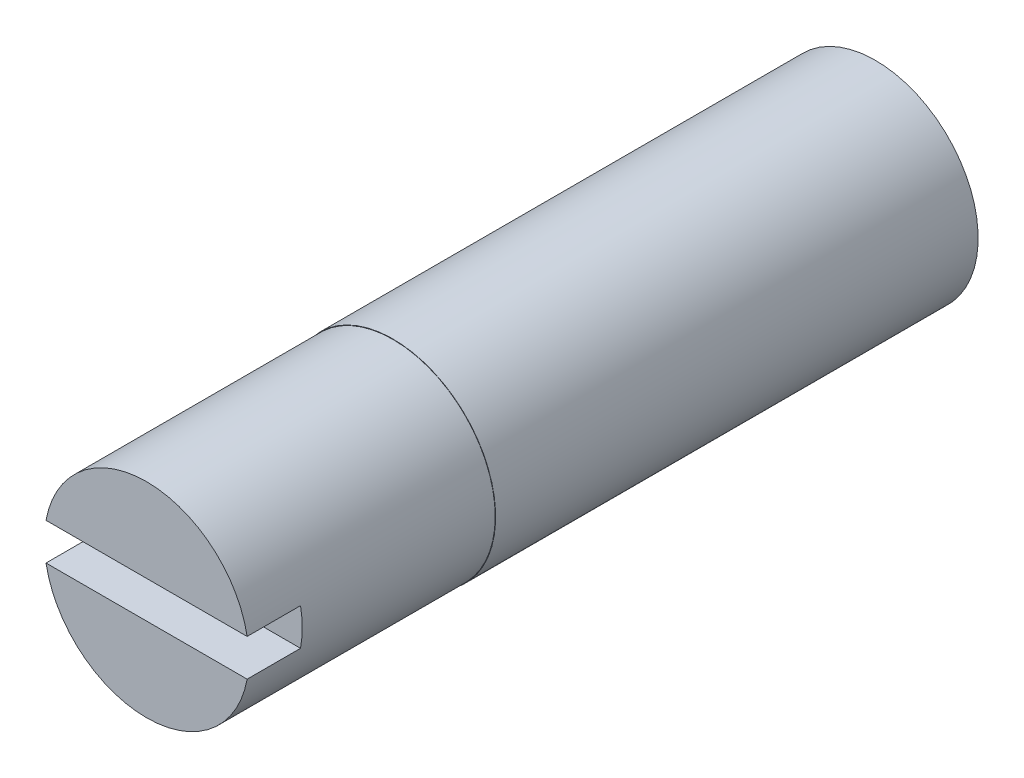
from build123d import *

# Parameters (mm, degrees)
SKETCH_1_R          = 2.49
EXTRUDE_1_DEPTH     = 6
SKETCH_8_W          = 2.5
SKETCH_8_H          = 0.45
CUT_EXTRUDE_2_DEPTH = 1.3
SKETCH_9_R          = 2.5
EXTRUDE_2_DEPTH     = 11.75


with BuildPart() as part:
    # Sketch 1 → Extrude 1 (new body)
    with BuildSketch(Plane.XY):
        Circle(SKETCH_1_R)
    extrude(amount=EXTRUDE_1_DEPTH)

    # Sketch 8 → Cut-Extrude 2 (cut)
    with BuildSketch(Plane.XY.offset(6)):
        with Locations((1.25, 0.225)):
            Rectangle(SKETCH_8_W, SKETCH_8_H)
        with Locations((1.25, -0.225)):
            Rectangle(SKETCH_8_W, SKETCH_8_H)
        Polygon((0, -0.45), (0, 0), (0, 0.45), (-2.5, 0.45), (-2.5, -0.45), align=None)
    extrude(amount=-CUT_EXTRUDE_2_DEPTH, mode=Mode.SUBTRACT)

    # Sketch 9 → Extrude 2 (add)
    with BuildSketch(Plane(origin=(0, 0, 0), x_dir=(-1, 0, 0), z_dir=(0, 0, -1))):
        Circle(SKETCH_9_R)
    extrude(amount=EXTRUDE_2_DEPTH)


solid = part.part
